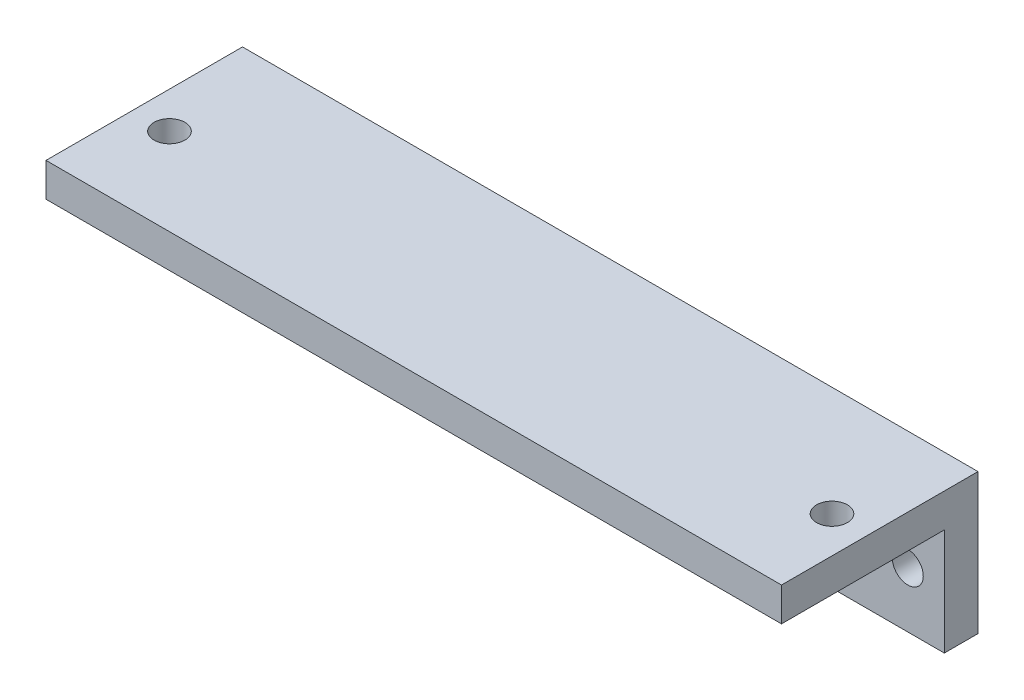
ISO-10303-21;
HEADER;
FILE_DESCRIPTION(('STEP AP214'),'2;1');
FILE_NAME('part.step','',(''),(''),'','','');
FILE_SCHEMA(('AUTOMOTIVE_DESIGN { 1 0 10303 214 1 1 1 1 }'));
ENDSEC;
DATA;
#1=APPLICATION_CONTEXT('core data for automotive mechanical design processes');
#2=APPLICATION_PROTOCOL_DEFINITION('international standard','automotive_design',2000,#1);
#3=PRODUCT_CONTEXT('',#1,'mechanical');
#4=PRODUCT('Part','Part','',(#3));
#5=PRODUCT_RELATED_PRODUCT_CATEGORY('part','',(#4));
#6=PRODUCT_DEFINITION_FORMATION('','',#4);
#7=PRODUCT_DEFINITION_CONTEXT('part definition',#1,'design');
#8=PRODUCT_DEFINITION('design','',#6,#7);
#9=PRODUCT_DEFINITION_SHAPE('','',#8);
#10=(LENGTH_UNIT() NAMED_UNIT(*) SI_UNIT(.MILLI.,.METRE.));
#11=(NAMED_UNIT(*) PLANE_ANGLE_UNIT() SI_UNIT($,.RADIAN.));
#12=(NAMED_UNIT(*) SI_UNIT($,.STERADIAN.) SOLID_ANGLE_UNIT());
#13=UNCERTAINTY_MEASURE_WITH_UNIT(LENGTH_MEASURE(1.E-05),#10,'distance_accuracy_value','');
#14=(GEOMETRIC_REPRESENTATION_CONTEXT(3) GLOBAL_UNCERTAINTY_ASSIGNED_CONTEXT((#13)) GLOBAL_UNIT_ASSIGNED_CONTEXT((#10,
#11,#12)) REPRESENTATION_CONTEXT('',''));
#15=CARTESIAN_POINT('',(0.,0.,0.));
#16=DIRECTION('',(0.,0.,1.));
#17=DIRECTION('',(1.,0.,0.));
#18=AXIS2_PLACEMENT_3D('',#15,#16,#17);
#19=CARTESIAN_POINT('',(-65.5,0.,6.));
#20=DIRECTION('',(0.,0.,1.));
#21=DIRECTION('',(1.,0.,0.));
#22=AXIS2_PLACEMENT_3D('',#19,#20,#21);
#23=PLANE('',#22);
#24=CARTESIAN_POINT('',(59.,-15.,6.));
#25=DIRECTION('',(0.,0.,1.));
#26=DIRECTION('',(1.,0.,0.));
#27=AXIS2_PLACEMENT_3D('',#24,#25,#26);
#28=CIRCLE('',#27,2.75);
#29=CARTESIAN_POINT('',(61.75,-15.,6.));
#30=VERTEX_POINT('',#29);
#31=EDGE_CURVE('E279',#30,#30,#28,.T.);
#32=ORIENTED_EDGE('',*,*,#31,.F.);
#33=EDGE_LOOP('',(#32));
#34=FACE_BOUND('',#33,.T.);
#35=CARTESIAN_POINT('',(-59.,-15.,6.));
#36=DIRECTION('',(0.,0.,1.));
#37=DIRECTION('',(1.,0.,0.));
#38=AXIS2_PLACEMENT_3D('',#35,#36,#37);
#39=CIRCLE('',#38,2.75);
#40=CARTESIAN_POINT('',(-56.25,-15.,6.));
#41=VERTEX_POINT('',#40);
#42=EDGE_CURVE('E112',#41,#41,#39,.T.);
#43=ORIENTED_EDGE('',*,*,#42,.F.);
#44=EDGE_LOOP('',(#43));
#45=FACE_BOUND('',#44,.T.);
#46=DIRECTION('',(0.,1.,0.));
#47=VECTOR('',#46,1.);
#48=CARTESIAN_POINT('',(65.5,0.,6.));
#49=LINE('',#48,#47);
#50=CARTESIAN_POINT('',(65.5,-25.,6.));
#51=VERTEX_POINT('',#50);
#52=CARTESIAN_POINT('',(65.5,-6.,6.));
#53=VERTEX_POINT('',#52);
#54=EDGE_CURVE('E47',#51,#53,#49,.T.);
#55=ORIENTED_EDGE('',*,*,#54,.T.);
#56=DIRECTION('',(-1.,0.,0.));
#57=VECTOR('',#56,1.);
#58=CARTESIAN_POINT('',(-65.5,-6.,6.));
#59=LINE('',#58,#57);
#60=CARTESIAN_POINT('',(-65.5,-6.,6.));
#61=VERTEX_POINT('',#60);
#62=EDGE_CURVE('E51',#53,#61,#59,.T.);
#63=ORIENTED_EDGE('',*,*,#62,.T.);
#64=DIRECTION('',(0.,-1.,0.));
#65=VECTOR('',#64,1.);
#66=CARTESIAN_POINT('',(-65.5,0.,6.));
#67=LINE('',#66,#65);
#68=CARTESIAN_POINT('',(-65.5,-25.,6.));
#69=VERTEX_POINT('',#68);
#70=EDGE_CURVE('E128',#61,#69,#67,.T.);
#71=ORIENTED_EDGE('',*,*,#70,.T.);
#72=DIRECTION('',(1.,0.,0.));
#73=VECTOR('',#72,1.);
#74=CARTESIAN_POINT('',(-65.5,-25.,6.));
#75=LINE('',#74,#73);
#76=EDGE_CURVE('E130',#69,#51,#75,.T.);
#77=ORIENTED_EDGE('',*,*,#76,.T.);
#78=EDGE_LOOP('',(#55,#63,#71,#77));
#79=FACE_BOUND('',#78,.T.);
#80=ADVANCED_FACE('F30',(#34,#45,#79),#23,.T.);
#81=CARTESIAN_POINT('',(-65.5,0.,6.));
#82=DIRECTION('',(1.,0.,0.));
#83=DIRECTION('',(0.,0.,-1.));
#84=AXIS2_PLACEMENT_3D('',#81,#82,#83);
#85=PLANE('',#84);
#86=DIRECTION('',(0.,-1.,0.));
#87=VECTOR('',#86,1.);
#88=CARTESIAN_POINT('',(-65.5,0.,0.));
#89=LINE('',#88,#87);
#90=CARTESIAN_POINT('',(-65.5,0.,0.));
#91=VERTEX_POINT('',#90);
#92=CARTESIAN_POINT('',(-65.5,-25.,0.));
#93=VERTEX_POINT('',#92);
#94=EDGE_CURVE('E121',#91,#93,#89,.T.);
#95=ORIENTED_EDGE('',*,*,#94,.T.);
#96=DIRECTION('',(0.,0.,-1.));
#97=VECTOR('',#96,1.);
#98=CARTESIAN_POINT('',(-65.5,-25.,6.));
#99=LINE('',#98,#97);
#100=EDGE_CURVE('E11',#69,#93,#99,.T.);
#101=ORIENTED_EDGE('',*,*,#100,.F.);
#102=ORIENTED_EDGE('',*,*,#70,.F.);
#103=DIRECTION('',(0.,0.,1.));
#104=VECTOR('',#103,1.);
#105=CARTESIAN_POINT('',(-65.5,-6.,0.));
#106=LINE('',#105,#104);
#107=CARTESIAN_POINT('',(-65.5,-6.,35.));
#108=VERTEX_POINT('',#107);
#109=EDGE_CURVE('E98',#61,#108,#106,.T.);
#110=ORIENTED_EDGE('',*,*,#109,.T.);
#111=DIRECTION('',(0.,1.,0.));
#112=VECTOR('',#111,1.);
#113=CARTESIAN_POINT('',(-65.5,-6.,35.));
#114=LINE('',#113,#112);
#115=CARTESIAN_POINT('',(-65.5,0.,35.));
#116=VERTEX_POINT('',#115);
#117=EDGE_CURVE('E96',#108,#116,#114,.T.);
#118=ORIENTED_EDGE('',*,*,#117,.T.);
#119=DIRECTION('',(0.,0.,-1.));
#120=VECTOR('',#119,1.);
#121=CARTESIAN_POINT('',(-65.5,0.,6.));
#122=LINE('',#121,#120);
#123=EDGE_CURVE('E83',#116,#91,#122,.T.);
#124=ORIENTED_EDGE('',*,*,#123,.T.);
#125=EDGE_LOOP('',(#95,#101,#102,#110,#118,#124));
#126=FACE_BOUND('',#125,.T.);
#127=ADVANCED_FACE('F32',(#126),#85,.F.);
#128=CARTESIAN_POINT('',(-65.5,-25.,6.));
#129=DIRECTION('',(0.,1.,0.));
#130=DIRECTION('',(-1.,0.,0.));
#131=AXIS2_PLACEMENT_3D('',#128,#129,#130);
#132=PLANE('',#131);
#133=DIRECTION('',(1.,0.,0.));
#134=VECTOR('',#133,1.);
#135=CARTESIAN_POINT('',(-65.5,-25.,0.));
#136=LINE('',#135,#134);
#137=CARTESIAN_POINT('',(65.5,-25.,0.));
#138=VERTEX_POINT('',#137);
#139=EDGE_CURVE('E123',#93,#138,#136,.T.);
#140=ORIENTED_EDGE('',*,*,#139,.T.);
#141=DIRECTION('',(0.,0.,-1.));
#142=VECTOR('',#141,1.);
#143=CARTESIAN_POINT('',(65.5,-25.,6.));
#144=LINE('',#143,#142);
#145=EDGE_CURVE('E39',#51,#138,#144,.T.);
#146=ORIENTED_EDGE('',*,*,#145,.F.);
#147=ORIENTED_EDGE('',*,*,#76,.F.);
#148=ORIENTED_EDGE('',*,*,#100,.T.);
#149=EDGE_LOOP('',(#140,#146,#147,#148));
#150=FACE_BOUND('',#149,.T.);
#151=ADVANCED_FACE('F145',(#150),#132,.F.);
#152=CARTESIAN_POINT('',(65.5,0.,6.));
#153=DIRECTION('',(-1.,0.,0.));
#154=DIRECTION('',(0.,0.,1.));
#155=AXIS2_PLACEMENT_3D('',#152,#153,#154);
#156=PLANE('',#155);
#157=DIRECTION('',(0.,0.,-1.));
#158=VECTOR('',#157,1.);
#159=CARTESIAN_POINT('',(65.5,0.,6.));
#160=LINE('',#159,#158);
#161=CARTESIAN_POINT('',(65.5,0.,35.));
#162=VERTEX_POINT('',#161);
#163=CARTESIAN_POINT('',(65.5,0.,0.));
#164=VERTEX_POINT('',#163);
#165=EDGE_CURVE('E93',#162,#164,#160,.T.);
#166=ORIENTED_EDGE('',*,*,#165,.F.);
#167=DIRECTION('',(0.,1.,0.));
#168=VECTOR('',#167,1.);
#169=CARTESIAN_POINT('',(65.5,-6.,35.));
#170=LINE('',#169,#168);
#171=CARTESIAN_POINT('',(65.5,-6.,35.));
#172=VERTEX_POINT('',#171);
#173=EDGE_CURVE('E102',#172,#162,#170,.T.);
#174=ORIENTED_EDGE('',*,*,#173,.F.);
#175=DIRECTION('',(0.,0.,-1.));
#176=VECTOR('',#175,1.);
#177=CARTESIAN_POINT('',(65.5,-6.,0.));
#178=LINE('',#177,#176);
#179=EDGE_CURVE('E103',#172,#53,#178,.T.);
#180=ORIENTED_EDGE('',*,*,#179,.T.);
#181=ORIENTED_EDGE('',*,*,#54,.F.);
#182=ORIENTED_EDGE('',*,*,#145,.T.);
#183=DIRECTION('',(0.,1.,0.));
#184=VECTOR('',#183,1.);
#185=CARTESIAN_POINT('',(65.5,0.,0.));
#186=LINE('',#185,#184);
#187=EDGE_CURVE('E125',#138,#164,#186,.T.);
#188=ORIENTED_EDGE('',*,*,#187,.T.);
#189=EDGE_LOOP('',(#166,#174,#180,#181,#182,#188));
#190=FACE_BOUND('',#189,.T.);
#191=ADVANCED_FACE('F138',(#190),#156,.F.);
#192=CARTESIAN_POINT('',(-65.5,0.,6.));
#193=DIRECTION('',(0.,-1.,0.));
#194=DIRECTION('',(0.,0.,-1.));
#195=AXIS2_PLACEMENT_3D('',#192,#193,#194);
#196=PLANE('',#195);
#197=CARTESIAN_POINT('',(59.,0.,19.5080976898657));
#198=DIRECTION('',(0.,-1.,0.));
#199=DIRECTION('',(0.,0.,-1.));
#200=AXIS2_PLACEMENT_3D('',#197,#198,#199);
#201=CIRCLE('',#200,2.75);
#202=CARTESIAN_POINT('',(59.,0.,16.7580976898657));
#203=VERTEX_POINT('',#202);
#204=EDGE_CURVE('E270',#203,#203,#201,.T.);
#205=ORIENTED_EDGE('',*,*,#204,.T.);
#206=EDGE_LOOP('',(#205));
#207=FACE_BOUND('',#206,.T.);
#208=CARTESIAN_POINT('',(-59.,0.,19.5080976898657));
#209=DIRECTION('',(0.,-1.,0.));
#210=DIRECTION('',(0.,0.,-1.));
#211=AXIS2_PLACEMENT_3D('',#208,#209,#210);
#212=CIRCLE('',#211,2.75);
#213=CARTESIAN_POINT('',(-59.,0.,16.7580976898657));
#214=VERTEX_POINT('',#213);
#215=EDGE_CURVE('E274',#214,#214,#212,.T.);
#216=ORIENTED_EDGE('',*,*,#215,.T.);
#217=EDGE_LOOP('',(#216));
#218=FACE_BOUND('',#217,.T.);
#219=DIRECTION('',(-1.,0.,0.));
#220=VECTOR('',#219,1.);
#221=CARTESIAN_POINT('',(-65.5,0.,0.));
#222=LINE('',#221,#220);
#223=EDGE_CURVE('E90',#164,#91,#222,.T.);
#224=ORIENTED_EDGE('',*,*,#223,.T.);
#225=ORIENTED_EDGE('',*,*,#123,.F.);
#226=DIRECTION('',(1.,0.,0.));
#227=VECTOR('',#226,1.);
#228=CARTESIAN_POINT('',(-65.5,0.,35.));
#229=LINE('',#228,#227);
#230=EDGE_CURVE('E88',#116,#162,#229,.T.);
#231=ORIENTED_EDGE('',*,*,#230,.T.);
#232=ORIENTED_EDGE('',*,*,#165,.T.);
#233=EDGE_LOOP('',(#224,#225,#231,#232));
#234=FACE_BOUND('',#233,.T.);
#235=ADVANCED_FACE('F85',(#207,#218,#234),#196,.F.);
#236=CARTESIAN_POINT('',(-65.5,0.,0.));
#237=DIRECTION('',(0.,0.,1.));
#238=DIRECTION('',(1.,0.,0.));
#239=AXIS2_PLACEMENT_3D('',#236,#237,#238);
#240=PLANE('',#239);
#241=CARTESIAN_POINT('',(59.,-15.,0.));
#242=DIRECTION('',(0.,0.,1.));
#243=DIRECTION('',(1.,0.,0.));
#244=AXIS2_PLACEMENT_3D('',#241,#242,#243);
#245=CIRCLE('',#244,2.75);
#246=CARTESIAN_POINT('',(61.75,-15.,0.));
#247=VERTEX_POINT('',#246);
#248=EDGE_CURVE('E34',#247,#247,#245,.T.);
#249=ORIENTED_EDGE('',*,*,#248,.T.);
#250=EDGE_LOOP('',(#249));
#251=FACE_BOUND('',#250,.T.);
#252=CARTESIAN_POINT('',(-59.,-15.,0.));
#253=DIRECTION('',(0.,0.,1.));
#254=DIRECTION('',(1.,0.,0.));
#255=AXIS2_PLACEMENT_3D('',#252,#253,#254);
#256=CIRCLE('',#255,2.75);
#257=CARTESIAN_POINT('',(-56.25,-15.,0.));
#258=VERTEX_POINT('',#257);
#259=EDGE_CURVE('E107',#258,#258,#256,.T.);
#260=ORIENTED_EDGE('',*,*,#259,.T.);
#261=EDGE_LOOP('',(#260));
#262=FACE_BOUND('',#261,.T.);
#263=ORIENTED_EDGE('',*,*,#223,.F.);
#264=ORIENTED_EDGE('',*,*,#187,.F.);
#265=ORIENTED_EDGE('',*,*,#139,.F.);
#266=ORIENTED_EDGE('',*,*,#94,.F.);
#267=EDGE_LOOP('',(#263,#264,#265,#266));
#268=FACE_BOUND('',#267,.T.);
#269=ADVANCED_FACE('F143',(#251,#262,#268),#240,.F.);
#270=CARTESIAN_POINT('',(-65.5,-6.,35.));
#271=DIRECTION('',(0.,0.,1.));
#272=DIRECTION('',(1.,0.,0.));
#273=AXIS2_PLACEMENT_3D('',#270,#271,#272);
#274=PLANE('',#273);
#275=ORIENTED_EDGE('',*,*,#230,.F.);
#276=ORIENTED_EDGE('',*,*,#117,.F.);
#277=DIRECTION('',(1.,0.,0.));
#278=VECTOR('',#277,1.);
#279=CARTESIAN_POINT('',(-65.5,-6.,35.));
#280=LINE('',#279,#278);
#281=EDGE_CURVE('E109',#108,#172,#280,.T.);
#282=ORIENTED_EDGE('',*,*,#281,.T.);
#283=ORIENTED_EDGE('',*,*,#173,.T.);
#284=EDGE_LOOP('',(#275,#276,#282,#283));
#285=FACE_BOUND('',#284,.T.);
#286=ADVANCED_FACE('F106',(#285),#274,.T.);
#287=CARTESIAN_POINT('',(-65.5,-6.,0.));
#288=DIRECTION('',(0.,1.,0.));
#289=DIRECTION('',(-1.,0.,0.));
#290=AXIS2_PLACEMENT_3D('',#287,#288,#289);
#291=PLANE('',#290);
#292=CARTESIAN_POINT('',(59.,-5.99999999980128,19.5080976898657));
#293=DIRECTION('',(0.,-1.,0.));
#294=DIRECTION('',(0.,0.,-1.));
#295=AXIS2_PLACEMENT_3D('',#292,#293,#294);
#296=CIRCLE('',#295,2.75);
#297=CARTESIAN_POINT('',(59.,-5.99999999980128,16.7580976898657));
#298=VERTEX_POINT('',#297);
#299=EDGE_CURVE('E267',#298,#298,#296,.T.);
#300=ORIENTED_EDGE('',*,*,#299,.F.);
#301=EDGE_LOOP('',(#300));
#302=FACE_BOUND('',#301,.T.);
#303=CARTESIAN_POINT('',(-59.,-5.99999999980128,19.5080976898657));
#304=DIRECTION('',(0.,-1.,0.));
#305=DIRECTION('',(0.,0.,-1.));
#306=AXIS2_PLACEMENT_3D('',#303,#304,#305);
#307=CIRCLE('',#306,2.75);
#308=CARTESIAN_POINT('',(-59.,-5.99999999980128,16.7580976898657));
#309=VERTEX_POINT('',#308);
#310=EDGE_CURVE('E271',#309,#309,#307,.T.);
#311=ORIENTED_EDGE('',*,*,#310,.F.);
#312=EDGE_LOOP('',(#311));
#313=FACE_BOUND('',#312,.T.);
#314=ORIENTED_EDGE('',*,*,#62,.F.);
#315=ORIENTED_EDGE('',*,*,#179,.F.);
#316=ORIENTED_EDGE('',*,*,#281,.F.);
#317=ORIENTED_EDGE('',*,*,#109,.F.);
#318=EDGE_LOOP('',(#314,#315,#316,#317));
#319=FACE_BOUND('',#318,.T.);
#320=ADVANCED_FACE('F189',(#302,#313,#319),#291,.F.);
#321=CARTESIAN_POINT('',(-59.,-15.,6.));
#322=DIRECTION('',(0.,0.,1.));
#323=DIRECTION('',(1.,0.,0.));
#324=AXIS2_PLACEMENT_3D('',#321,#322,#323);
#325=CYLINDRICAL_SURFACE('',#324,2.75);
#326=ORIENTED_EDGE('',*,*,#42,.T.);
#327=EDGE_LOOP('',(#326));
#328=FACE_BOUND('',#327,.T.);
#329=ORIENTED_EDGE('',*,*,#259,.F.);
#330=EDGE_LOOP('',(#329));
#331=FACE_BOUND('',#330,.T.);
#332=ADVANCED_FACE('F194',(#328,#331),#325,.F.);
#333=CARTESIAN_POINT('',(59.,-15.,6.));
#334=DIRECTION('',(0.,0.,1.));
#335=DIRECTION('',(1.,0.,0.));
#336=AXIS2_PLACEMENT_3D('',#333,#334,#335);
#337=CYLINDRICAL_SURFACE('',#336,2.75);
#338=ORIENTED_EDGE('',*,*,#31,.T.);
#339=EDGE_LOOP('',(#338));
#340=FACE_BOUND('',#339,.T.);
#341=ORIENTED_EDGE('',*,*,#248,.F.);
#342=EDGE_LOOP('',(#341));
#343=FACE_BOUND('',#342,.T.);
#344=ADVANCED_FACE('F202',(#340,#343),#337,.F.);
#345=CARTESIAN_POINT('',(-59.,-5.99999999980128,19.5080976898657));
#346=DIRECTION('',(0.,-1.,0.));
#347=DIRECTION('',(0.,0.,-1.));
#348=AXIS2_PLACEMENT_3D('',#345,#346,#347);
#349=CYLINDRICAL_SURFACE('',#348,2.75);
#350=ORIENTED_EDGE('',*,*,#310,.T.);
#351=EDGE_LOOP('',(#350));
#352=FACE_BOUND('',#351,.T.);
#353=ORIENTED_EDGE('',*,*,#215,.F.);
#354=EDGE_LOOP('',(#353));
#355=FACE_BOUND('',#354,.T.);
#356=ADVANCED_FACE('F209',(#352,#355),#349,.F.);
#357=CARTESIAN_POINT('',(59.,-5.99999999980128,19.5080976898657));
#358=DIRECTION('',(0.,-1.,0.));
#359=DIRECTION('',(0.,0.,-1.));
#360=AXIS2_PLACEMENT_3D('',#357,#358,#359);
#361=CYLINDRICAL_SURFACE('',#360,2.75);
#362=ORIENTED_EDGE('',*,*,#299,.T.);
#363=EDGE_LOOP('',(#362));
#364=FACE_BOUND('',#363,.T.);
#365=ORIENTED_EDGE('',*,*,#204,.F.);
#366=EDGE_LOOP('',(#365));
#367=FACE_BOUND('',#366,.T.);
#368=ADVANCED_FACE('F216',(#364,#367),#361,.F.);
#369=CLOSED_SHELL('',(#80,#127,#151,#191,#235,#269,#286,#320,#332,#344,#356,#368));
#370=MANIFOLD_SOLID_BREP('B2',#369);
#371=ADVANCED_BREP_SHAPE_REPRESENTATION('',(#18,#370),#14);
#372=SHAPE_DEFINITION_REPRESENTATION(#9,#371);
ENDSEC;
END-ISO-10303-21;
